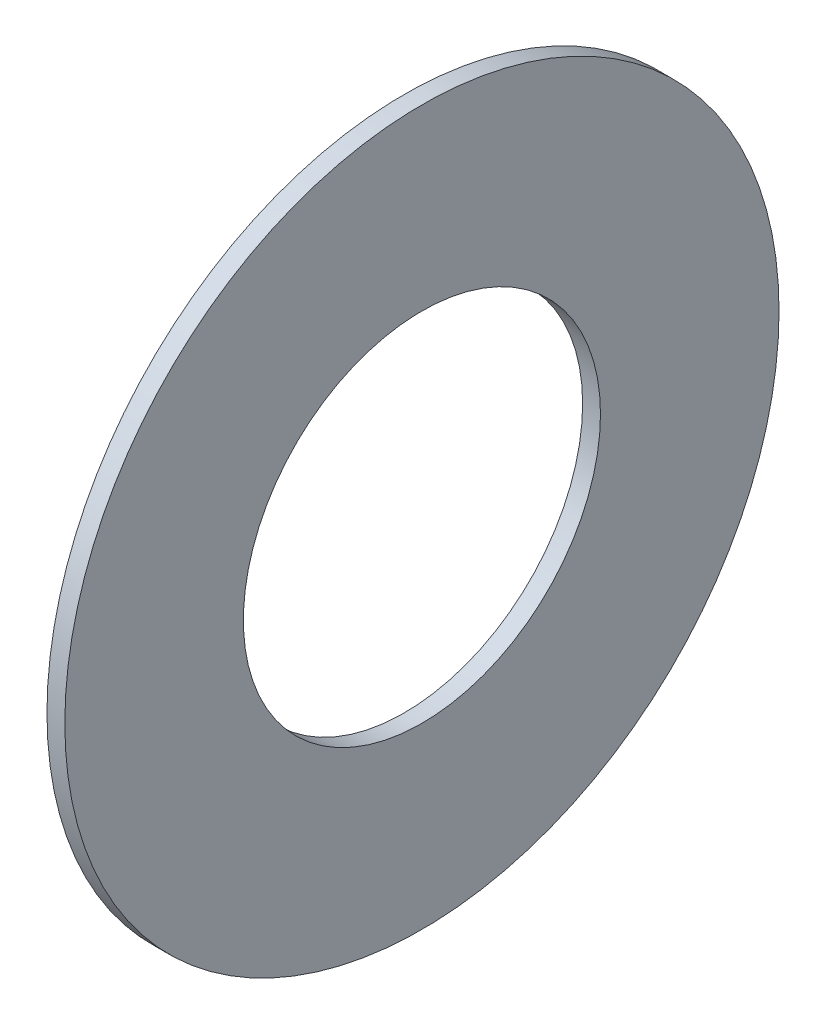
ISO-10303-21;
HEADER;
FILE_DESCRIPTION(('STEP AP214'),'2;1');
FILE_NAME('part.step','',(''),(''),'','','');
FILE_SCHEMA(('AUTOMOTIVE_DESIGN { 1 0 10303 214 1 1 1 1 }'));
ENDSEC;
DATA;
#1=APPLICATION_CONTEXT('core data for automotive mechanical design processes');
#2=APPLICATION_PROTOCOL_DEFINITION('international standard','automotive_design',2000,#1);
#3=PRODUCT_CONTEXT('',#1,'mechanical');
#4=PRODUCT('Part','Part','',(#3));
#5=PRODUCT_RELATED_PRODUCT_CATEGORY('part','',(#4));
#6=PRODUCT_DEFINITION_FORMATION('','',#4);
#7=PRODUCT_DEFINITION_CONTEXT('part definition',#1,'design');
#8=PRODUCT_DEFINITION('design','',#6,#7);
#9=PRODUCT_DEFINITION_SHAPE('','',#8);
#10=(LENGTH_UNIT() NAMED_UNIT(*) SI_UNIT(.MILLI.,.METRE.));
#11=(NAMED_UNIT(*) PLANE_ANGLE_UNIT() SI_UNIT($,.RADIAN.));
#12=(NAMED_UNIT(*) SI_UNIT($,.STERADIAN.) SOLID_ANGLE_UNIT());
#13=UNCERTAINTY_MEASURE_WITH_UNIT(LENGTH_MEASURE(1.E-05),#10,'distance_accuracy_value','');
#14=(GEOMETRIC_REPRESENTATION_CONTEXT(3) GLOBAL_UNCERTAINTY_ASSIGNED_CONTEXT((#13)) GLOBAL_UNIT_ASSIGNED_CONTEXT((#10,
#11,#12)) REPRESENTATION_CONTEXT('',''));
#15=CARTESIAN_POINT('',(0.,0.,0.));
#16=DIRECTION('',(0.,0.,1.));
#17=DIRECTION('',(1.,0.,0.));
#18=AXIS2_PLACEMENT_3D('',#15,#16,#17);
#19=CARTESIAN_POINT('',(0.2,0.,0.));
#20=DIRECTION('',(1.,0.,0.));
#21=DIRECTION('',(0.,0.,-1.));
#22=AXIS2_PLACEMENT_3D('',#19,#20,#21);
#23=PLANE('',#22);
#24=CARTESIAN_POINT('',(0.2,0.,0.));
#25=DIRECTION('',(1.,0.,0.));
#26=DIRECTION('',(0.,0.,-1.));
#27=AXIS2_PLACEMENT_3D('',#24,#25,#26);
#28=CIRCLE('',#27,4.);
#29=CARTESIAN_POINT('',(0.2,0.,-4.));
#30=VERTEX_POINT('',#29);
#31=EDGE_CURVE('E27',#30,#30,#28,.F.);
#32=ORIENTED_EDGE('',*,*,#31,.F.);
#33=EDGE_LOOP('',(#32));
#34=FACE_BOUND('',#33,.T.);
#35=CARTESIAN_POINT('',(0.2,0.,0.));
#36=DIRECTION('',(1.,0.,0.));
#37=DIRECTION('',(0.,0.,-1.));
#38=AXIS2_PLACEMENT_3D('',#35,#36,#37);
#39=CIRCLE('',#38,2.);
#40=CARTESIAN_POINT('',(0.2,0.,-2.));
#41=VERTEX_POINT('',#40);
#42=EDGE_CURVE('E18',#41,#41,#39,.F.);
#43=ORIENTED_EDGE('',*,*,#42,.T.);
#44=EDGE_LOOP('',(#43));
#45=FACE_BOUND('',#44,.T.);
#46=ADVANCED_FACE('F15',(#34,#45),#23,.T.);
#47=CARTESIAN_POINT('',(0.,0.,0.));
#48=DIRECTION('',(1.,0.,0.));
#49=DIRECTION('',(0.,0.,-1.));
#50=AXIS2_PLACEMENT_3D('',#47,#48,#49);
#51=CYLINDRICAL_SURFACE('',#50,2.);
#52=CARTESIAN_POINT('',(0.,0.,0.));
#53=DIRECTION('',(1.,0.,0.));
#54=DIRECTION('',(0.,0.,-1.));
#55=AXIS2_PLACEMENT_3D('',#52,#53,#54);
#56=CIRCLE('',#55,2.);
#57=CARTESIAN_POINT('',(0.,0.,-2.));
#58=VERTEX_POINT('',#57);
#59=EDGE_CURVE('E22',#58,#58,#56,.T.);
#60=ORIENTED_EDGE('',*,*,#59,.F.);
#61=EDGE_LOOP('',(#60));
#62=FACE_BOUND('',#61,.T.);
#63=ORIENTED_EDGE('',*,*,#42,.F.);
#64=EDGE_LOOP('',(#63));
#65=FACE_BOUND('',#64,.T.);
#66=ADVANCED_FACE('F36',(#62,#65),#51,.F.);
#67=CARTESIAN_POINT('',(0.,0.,0.));
#68=DIRECTION('',(1.,0.,0.));
#69=DIRECTION('',(0.,0.,-1.));
#70=AXIS2_PLACEMENT_3D('',#67,#68,#69);
#71=CYLINDRICAL_SURFACE('',#70,4.);
#72=CARTESIAN_POINT('',(0.,0.,0.));
#73=DIRECTION('',(1.,0.,0.));
#74=DIRECTION('',(0.,0.,-1.));
#75=AXIS2_PLACEMENT_3D('',#72,#73,#74);
#76=CIRCLE('',#75,4.);
#77=CARTESIAN_POINT('',(0.,0.,-4.));
#78=VERTEX_POINT('',#77);
#79=EDGE_CURVE('E10',#78,#78,#76,.F.);
#80=ORIENTED_EDGE('',*,*,#79,.F.);
#81=EDGE_LOOP('',(#80));
#82=FACE_BOUND('',#81,.T.);
#83=ORIENTED_EDGE('',*,*,#31,.T.);
#84=EDGE_LOOP('',(#83));
#85=FACE_BOUND('',#84,.T.);
#86=ADVANCED_FACE('F38',(#82,#85),#71,.T.);
#87=CARTESIAN_POINT('',(0.,0.,0.));
#88=DIRECTION('',(-1.,0.,0.));
#89=DIRECTION('',(0.,0.,1.));
#90=AXIS2_PLACEMENT_3D('',#87,#88,#89);
#91=PLANE('',#90);
#92=ORIENTED_EDGE('',*,*,#79,.T.);
#93=EDGE_LOOP('',(#92));
#94=FACE_BOUND('',#93,.T.);
#95=ORIENTED_EDGE('',*,*,#59,.T.);
#96=EDGE_LOOP('',(#95));
#97=FACE_BOUND('',#96,.T.);
#98=ADVANCED_FACE('F45',(#94,#97),#91,.T.);
#99=CLOSED_SHELL('',(#46,#66,#86,#98));
#100=MANIFOLD_SOLID_BREP('B1',#99);
#101=ADVANCED_BREP_SHAPE_REPRESENTATION('',(#18,#100),#14);
#102=SHAPE_DEFINITION_REPRESENTATION(#9,#101);
ENDSEC;
END-ISO-10303-21;
